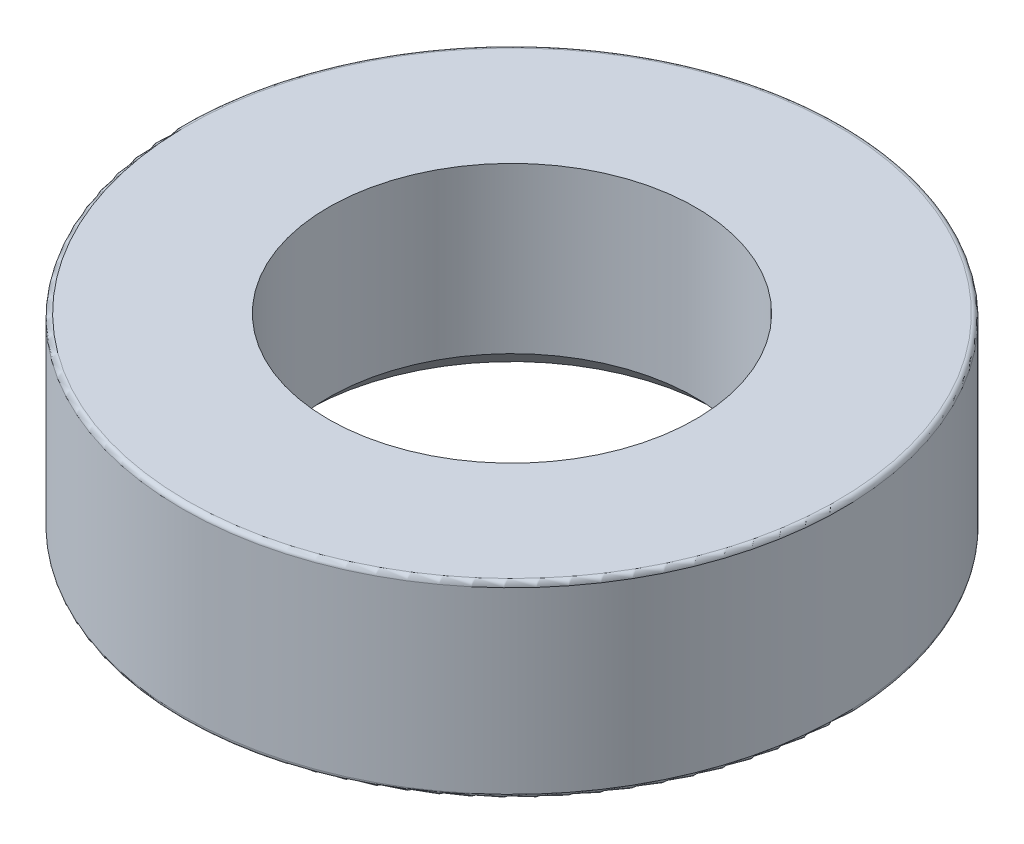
from build123d import *

# Parameters (mm, degrees)
SKETCH1_R           = 7
BOSS_EXTRUDE1_DEPTH = 2
CUT_EXTRUDE1_REACH  = 12.677
SKETCH2_R           = 3.9
CHAMFER1_SIZE       = 0.5
FILLET1_R           = 0.1


with BuildPart() as part:
    # Sketch1 → Boss-Extrude1 (new, symmetric)
    with BuildSketch(Plane(origin=(0, 0, 0), x_dir=(1, 0, 0), z_dir=(0, 1, 0))):
        with Locations(Location((0, 0, 0), (0, 0, 270))):
            Circle(SKETCH1_R)
    extrude(amount=BOSS_EXTRUDE1_DEPTH, both=True)

    # Sketch2 → Cut-Extrude1 (cut, up to next)
    with BuildSketch(Plane(origin=(0, 2, 0), x_dir=(1, 0, 0), z_dir=(0, 1, 0)), mode=Mode.PRIVATE) as cut_extrude1_sk1:
        with Locations(Location((0, 0, 0), (0, 0, 270))):
            Circle(SKETCH2_R)
    cut_extrude1_tool1 = extrude(cut_extrude1_sk1.sketch, amount=-CUT_EXTRUDE1_REACH, mode=Mode.PRIVATE) & part.part
    add(cut_extrude1_tool1.solids().sort_by_distance((0, 2, 0))[0], mode=Mode.SUBTRACT)

    # Chamfer1
    chamfer1_edges = [part.edges().sort_by_distance(p)[0] for p in [
        (0, -2, -3.9),
    ]]
    chamfer(chamfer1_edges, length=CHAMFER1_SIZE)

    # Fillet1
    fillet1_edges = [part.edges().sort_by_distance(p)[0] for p in [
        (0, -2, -7),
        (0, 2, -7),
    ]]
    fillet(fillet1_edges, radius=FILLET1_R)


solid = part.part
